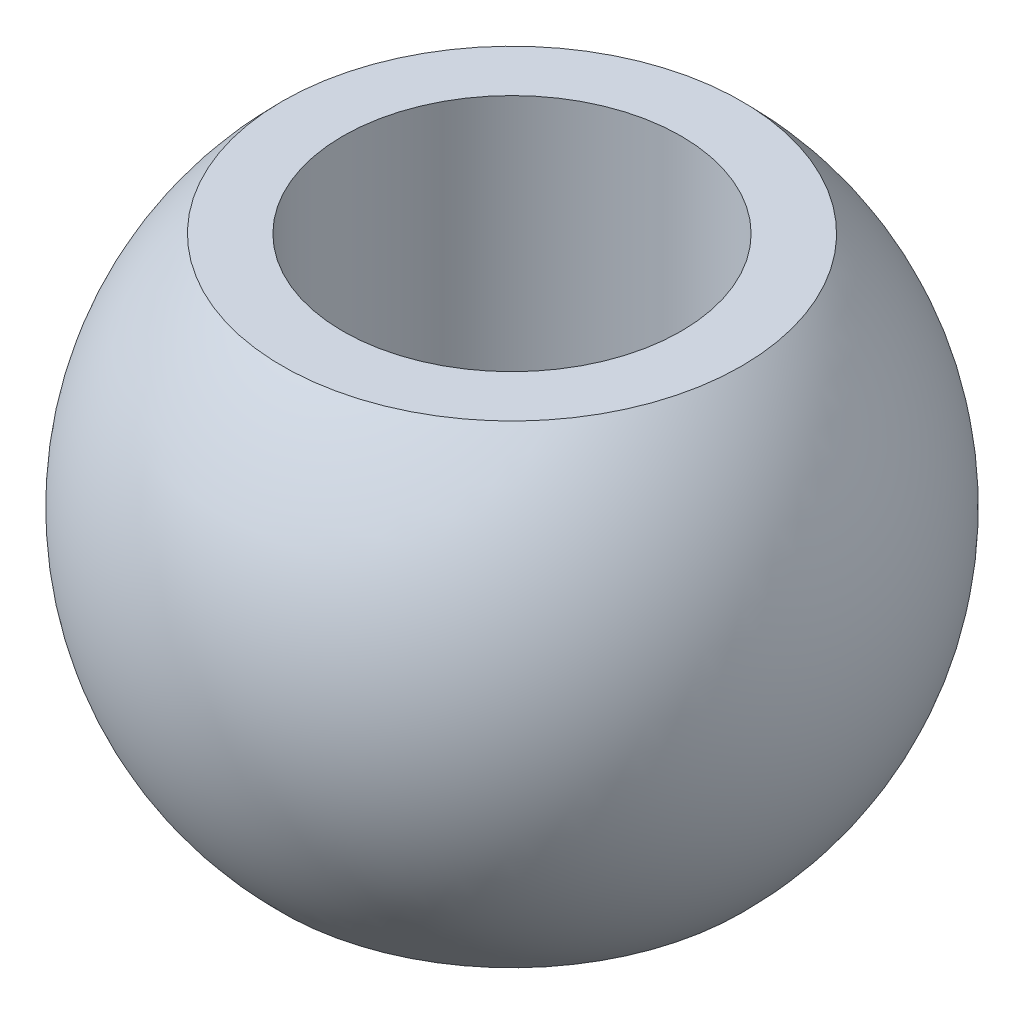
from build123d import *


with BuildPart() as part:
    # Esquisse1 → R_volution1 (revolve)
    with BuildSketch(Plane.XY, mode=Mode.PRIVATE) as r_volution1_sk:
        with BuildLine():
            Line((5, 7), (5, -7))
            Line((5, -7), (6.78693598, -7))
            ThreePointArc((6.78693598, -7), (9.75, 0), (6.78693598, 7))
            Line((6.78693598, 7), (5, 7))
        make_face()
    revolve(r_volution1_sk.sketch.rotate(Axis((0, 0, 0), (0, 1, 0)), 90), axis=Axis((0, 0, 0), (0, 1, 0)))


solid = part.part
